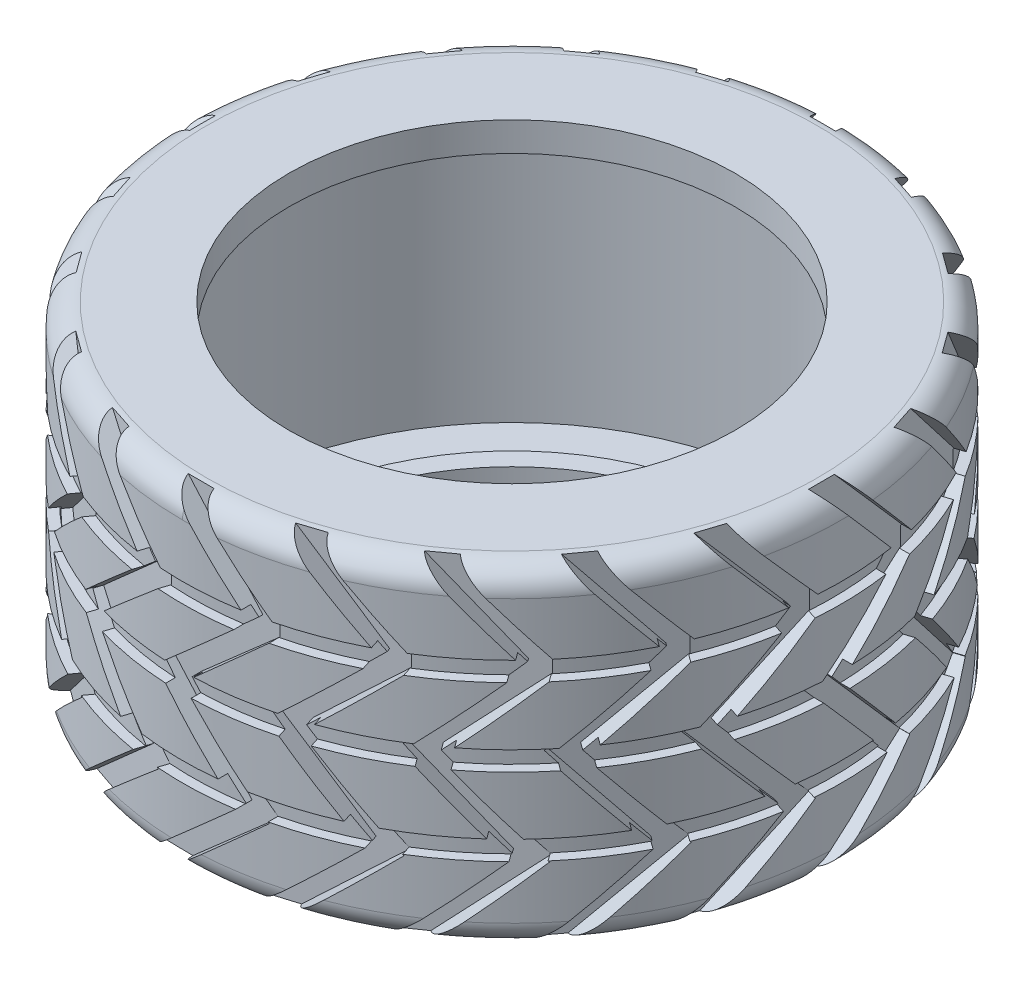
from build123d import *

# Parameters (mm, degrees)
SKETCH2_W          = 2.742238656
SKETCH2_H          = 2
CUT_EXTRUDE1_DEPTH = 2
CIRPATTERN1_COUNT  = 20


with BuildPart() as part:
    # Sketch1 → Revolve1 (revolve)
    with BuildSketch(Plane.XY, mode=Mode.PRIVATE) as revolve1_sk:
        with BuildLine():
            Line((31.5, -17), (23, -17))
            Line((23, -17), (23, -14))
            Line((23, -14), (25, -14))
            Line((25, -14), (25, -15))
            Line((25, -15), (30, -15))
            Line((30, -15), (30, 15))
            Line((30, 15), (25, 15))
            Line((25, 15), (25, 14))
            Line((25, 14), (23, 14))
            Line((23, 14), (23, 17))
            Line((23, 17), (31.5, 17))
            ThreePointArc((31.5, 17), (33.267766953, 16.267766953), (34, 14.5))
            Line((34, 14.5), (34, -14.5))
            ThreePointArc((34, -14.5), (33.267766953, -16.267766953), (31.5, -17))
        make_face()
    revolve(revolve1_sk.sketch.rotate(Axis((0, 83.637931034, 0), (0, -1, 0)), 90), axis=Axis((0, 83.637931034, 0), (0, -1, 0)))

    # Sketch2 → Cut-Revolve1 (revolve, cut)
    with BuildSketch(Plane.XY, mode=Mode.PRIVATE) as cut_revolve1_sk:
        with Locations((34.371119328, 8)):
            Rectangle(SKETCH2_W, SKETCH2_H)
        with Locations((34.371119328, 0)):
            Rectangle(SKETCH2_W, SKETCH2_H)
        with Locations((34.371119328, -8)):
            Rectangle(SKETCH2_W, SKETCH2_H)
    revolve(cut_revolve1_sk.sketch.rotate(Axis((0, 29.828243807, 0), (0, -1, 0)), 90), axis=Axis((0, 29.828243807, 0), (0, -1, 0)), mode=Mode.SUBTRACT)

    # Sketch3 → Cut-Extrude1 (cut)
    with BuildSketch(Plane(origin=(34, 0, 0), x_dir=(0, 0, -1), z_dir=(1, 0, 0))):
        Polygon((0, 0), (9.113313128, 8), (1.113313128, 17.113313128), (-1.547962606, 17.113313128), (-0.247933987, 15.632367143), (6.29085231, 8.183616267), (-2.822460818, 0.183616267), (5.177539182, -8.92969686), (-2.432735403, -15.610274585), (-4.144943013, -17.113313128), (-1.113313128, -17.113313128), (8, -9.113313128), align=None)
    cut_extrude1 = extrude(amount=-CUT_EXTRUDE1_DEPTH, mode=Mode.SUBTRACT)

    # CirPattern1: Cut-Extrude1 ×20 about axis
    cirpattern1_axis = Axis((0, 0, 0), (0, 1, 0))
    for i in range(1, CIRPATTERN1_COUNT):
        add(cut_extrude1.rotate(cirpattern1_axis, i * 360 / CIRPATTERN1_COUNT), mode=Mode.SUBTRACT)


solid = part.part
